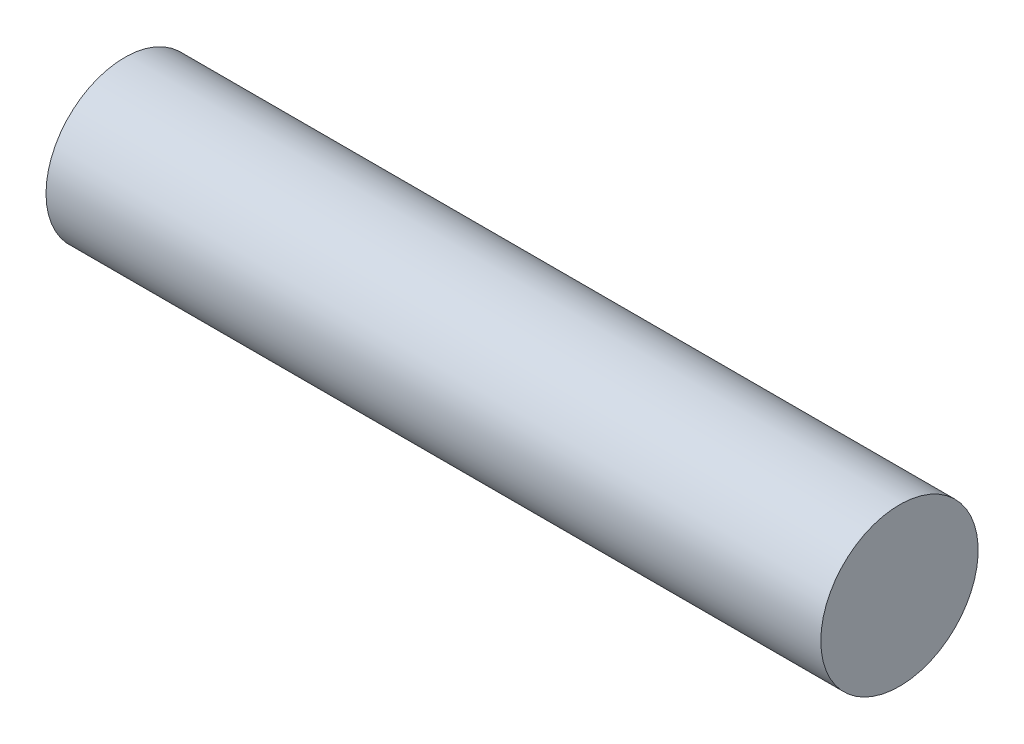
from build123d import *

# Parameters (mm, degrees)
SKIZZE1_W = 72.805271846
SKIZZE1_H = 7.392232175


with BuildPart() as part:
    # Skizze1 → Rotation1 (revolve)
    with BuildSketch(Plane.XY, mode=Mode.PRIVATE) as rotation1_sk:
        with Locations((0.649651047, -3.696116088)):
            Rectangle(SKIZZE1_W, SKIZZE1_H)
    revolve(rotation1_sk.sketch.rotate(Axis((-46.756680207, 0, 0), (1, 0, 0)), 270), axis=Axis((-46.756680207, 0, 0), (1, 0, 0)))


solid = part.part
